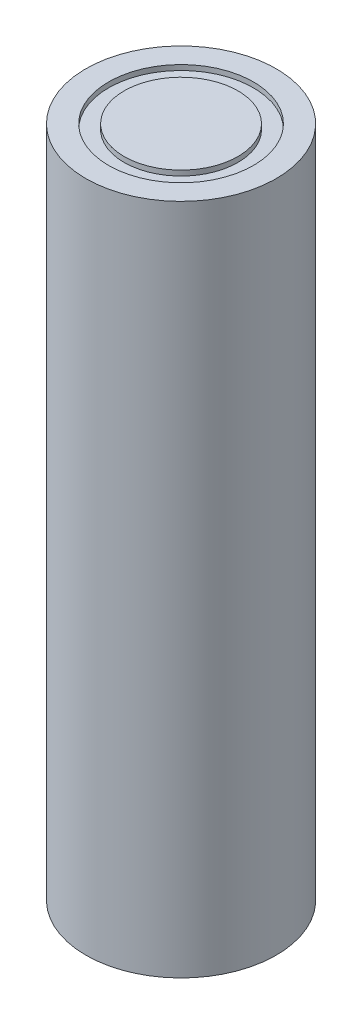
from build123d import *


with BuildPart() as part:
    # Esquisse1 → R_volution1 (revolve)
    with BuildSketch(Plane.XY, mode=Mode.PRIVATE) as r_volution1_sk:
        Polygon((0, 32.5), (5.5, 32.5), (5.5, 32), (7, 32), (7, 32.5), (9.2, 32.5), (9.2, -32.5), (7.4, -32.5), (7.4, -32.3), (7.2, -32.3), (7.2, -32.5), (0, -32.5), align=None)
    revolve(r_volution1_sk.sketch.rotate(Axis((0, -32.5, 0), (0, -1, 0)), 90), axis=Axis((0, -32.5, 0), (0, -1, 0)))


solid = part.part
